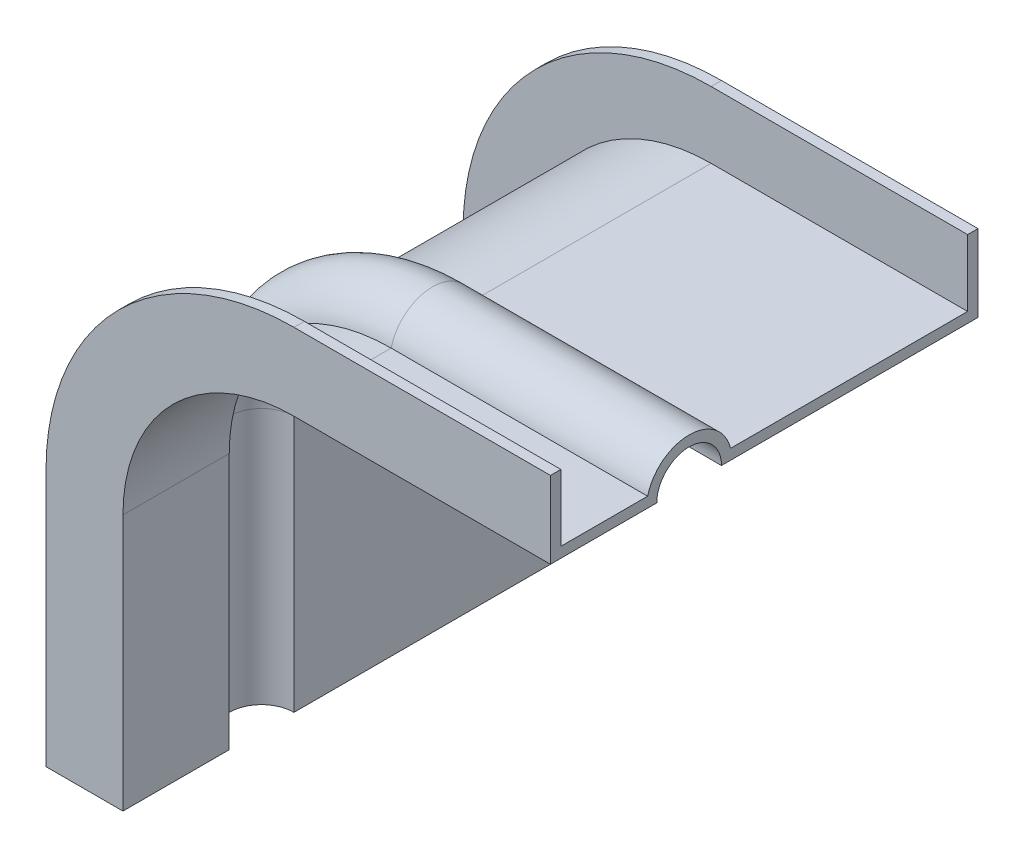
ISO-10303-21;
HEADER;
FILE_DESCRIPTION(('STEP AP214'),'2;1');
FILE_NAME('part.step','',(''),(''),'','','');
FILE_SCHEMA(('AUTOMOTIVE_DESIGN { 1 0 10303 214 1 1 1 1 }'));
ENDSEC;
DATA;
#1=APPLICATION_CONTEXT('core data for automotive mechanical design processes');
#2=APPLICATION_PROTOCOL_DEFINITION('international standard','automotive_design',2000,#1);
#3=PRODUCT_CONTEXT('',#1,'mechanical');
#4=PRODUCT('Part','Part','',(#3));
#5=PRODUCT_RELATED_PRODUCT_CATEGORY('part','',(#4));
#6=PRODUCT_DEFINITION_FORMATION('','',#4);
#7=PRODUCT_DEFINITION_CONTEXT('part definition',#1,'design');
#8=PRODUCT_DEFINITION('design','',#6,#7);
#9=PRODUCT_DEFINITION_SHAPE('','',#8);
#10=(LENGTH_UNIT() NAMED_UNIT(*) SI_UNIT(.MILLI.,.METRE.));
#11=(NAMED_UNIT(*) PLANE_ANGLE_UNIT() SI_UNIT($,.RADIAN.));
#12=(NAMED_UNIT(*) SI_UNIT($,.STERADIAN.) SOLID_ANGLE_UNIT());
#13=UNCERTAINTY_MEASURE_WITH_UNIT(LENGTH_MEASURE(1.E-05),#10,'distance_accuracy_value','');
#14=(GEOMETRIC_REPRESENTATION_CONTEXT(3) GLOBAL_UNCERTAINTY_ASSIGNED_CONTEXT((#13)) GLOBAL_UNIT_ASSIGNED_CONTEXT((#10,
#11,#12)) REPRESENTATION_CONTEXT('',''));
#15=CARTESIAN_POINT('',(0.,0.,0.));
#16=DIRECTION('',(0.,0.,1.));
#17=DIRECTION('',(1.,0.,0.));
#18=AXIS2_PLACEMENT_3D('',#15,#16,#17);
#19=CARTESIAN_POINT('',(20.,59.,50.));
#20=DIRECTION('',(0.,1.,0.));
#21=DIRECTION('',(0.,0.,1.));
#22=AXIS2_PLACEMENT_3D('',#19,#20,#21);
#23=PLANE('',#22);
#24=DIRECTION('',(0.,0.,1.));
#25=VECTOR('',#24,1.);
#26=CARTESIAN_POINT('',(20.,59.,50.));
#27=LINE('',#26,#25);
#28=CARTESIAN_POINT('',(20.,59.,48.786));
#29=VERTEX_POINT('',#28);
#30=CARTESIAN_POINT('',(20.,59.,50.));
#31=VERTEX_POINT('',#30);
#32=EDGE_CURVE('E199',#29,#31,#27,.T.);
#33=ORIENTED_EDGE('',*,*,#32,.T.);
#34=DIRECTION('',(1.,0.,0.));
#35=VECTOR('',#34,1.);
#36=CARTESIAN_POINT('',(20.,59.,50.));
#37=LINE('',#36,#35);
#38=CARTESIAN_POINT('',(50.,59.,50.));
#39=VERTEX_POINT('',#38);
#40=EDGE_CURVE('E37',#31,#39,#37,.T.);
#41=ORIENTED_EDGE('',*,*,#40,.T.);
#42=DIRECTION('',(0.,0.,1.));
#43=VECTOR('',#42,1.);
#44=CARTESIAN_POINT('',(50.,59.,50.));
#45=LINE('',#44,#43);
#46=CARTESIAN_POINT('',(50.,59.,48.786));
#47=VERTEX_POINT('',#46);
#48=EDGE_CURVE('E44',#47,#39,#45,.T.);
#49=ORIENTED_EDGE('',*,*,#48,.F.);
#50=DIRECTION('',(1.,0.,0.));
#51=VECTOR('',#50,1.);
#52=CARTESIAN_POINT('',(20.,59.,48.786));
#53=LINE('',#52,#51);
#54=EDGE_CURVE('E11',#29,#47,#53,.T.);
#55=ORIENTED_EDGE('',*,*,#54,.F.);
#56=EDGE_LOOP('',(#33,#41,#49,#55));
#57=FACE_BOUND('',#56,.T.);
#58=ADVANCED_FACE('F30',(#57),#23,.T.);
#59=CARTESIAN_POINT('',(20.,50.,50.));
#60=DIRECTION('',(0.,-1.,0.));
#61=DIRECTION('',(0.,0.,-1.));
#62=AXIS2_PLACEMENT_3D('',#59,#60,#61);
#63=PLANE('',#62);
#64=DIRECTION('',(0.,0.,-1.));
#65=VECTOR('',#64,1.);
#66=CARTESIAN_POINT('',(20.,50.,50.));
#67=LINE('',#66,#65);
#68=CARTESIAN_POINT('',(20.,50.,50.));
#69=VERTEX_POINT('',#68);
#70=CARTESIAN_POINT('',(20.,50.,37.572));
#71=VERTEX_POINT('',#70);
#72=EDGE_CURVE('E242',#69,#71,#67,.T.);
#73=ORIENTED_EDGE('',*,*,#72,.T.);
#74=DIRECTION('',(1.,0.,0.));
#75=VECTOR('',#74,1.);
#76=CARTESIAN_POINT('',(20.,50.,37.572));
#77=LINE('',#76,#75);
#78=CARTESIAN_POINT('',(50.,50.,37.572));
#79=VERTEX_POINT('',#78);
#80=EDGE_CURVE('E331',#71,#79,#77,.T.);
#81=ORIENTED_EDGE('',*,*,#80,.T.);
#82=DIRECTION('',(0.,0.,-1.));
#83=VECTOR('',#82,1.);
#84=CARTESIAN_POINT('',(50.,50.,50.));
#85=LINE('',#84,#83);
#86=CARTESIAN_POINT('',(50.,50.,50.));
#87=VERTEX_POINT('',#86);
#88=EDGE_CURVE('E302',#87,#79,#85,.T.);
#89=ORIENTED_EDGE('',*,*,#88,.F.);
#90=DIRECTION('',(1.,0.,0.));
#91=VECTOR('',#90,1.);
#92=CARTESIAN_POINT('',(20.,50.,50.));
#93=LINE('',#92,#91);
#94=EDGE_CURVE('E334',#69,#87,#93,.T.);
#95=ORIENTED_EDGE('',*,*,#94,.F.);
#96=EDGE_LOOP('',(#73,#81,#89,#95));
#97=FACE_BOUND('',#96,.T.);
#98=ADVANCED_FACE('F402',(#97),#63,.T.);
#99=CARTESIAN_POINT('',(20.,50.,33.786));
#100=DIRECTION('',(1.,0.,0.));
#101=DIRECTION('',(0.,0.,-1.));
#102=AXIS2_PLACEMENT_3D('',#99,#100,#101);
#103=CYLINDRICAL_SURFACE('',#102,3.786);
#104=CARTESIAN_POINT('',(20.,50.,33.786));
#105=DIRECTION('',(-1.,0.,0.));
#106=DIRECTION('',(0.,0.,-1.));
#107=AXIS2_PLACEMENT_3D('',#104,#105,#106);
#108=CIRCLE('',#107,3.786);
#109=CARTESIAN_POINT('',(20.,50.,30.));
#110=VERTEX_POINT('',#109);
#111=EDGE_CURVE('E239',#71,#110,#108,.T.);
#112=ORIENTED_EDGE('',*,*,#111,.T.);
#113=DIRECTION('',(1.,0.,0.));
#114=VECTOR('',#113,1.);
#115=CARTESIAN_POINT('',(20.,50.,30.));
#116=LINE('',#115,#114);
#117=CARTESIAN_POINT('',(50.,50.,30.));
#118=VERTEX_POINT('',#117);
#119=EDGE_CURVE('E328',#110,#118,#116,.T.);
#120=ORIENTED_EDGE('',*,*,#119,.T.);
#121=CARTESIAN_POINT('',(50.,50.,33.786));
#122=DIRECTION('',(-1.,0.,0.));
#123=DIRECTION('',(0.,0.,-1.));
#124=AXIS2_PLACEMENT_3D('',#121,#122,#123);
#125=CIRCLE('',#124,3.786);
#126=EDGE_CURVE('E299',#79,#118,#125,.T.);
#127=ORIENTED_EDGE('',*,*,#126,.F.);
#128=ORIENTED_EDGE('',*,*,#80,.F.);
#129=EDGE_LOOP('',(#112,#120,#127,#128));
#130=FACE_BOUND('',#129,.T.);
#131=ADVANCED_FACE('F408',(#130),#103,.F.);
#132=CARTESIAN_POINT('',(20.,50.,30.));
#133=DIRECTION('',(0.,-1.,0.));
#134=DIRECTION('',(0.,0.,-1.));
#135=AXIS2_PLACEMENT_3D('',#132,#133,#134);
#136=PLANE('',#135);
#137=DIRECTION('',(0.,0.,-1.));
#138=VECTOR('',#137,1.);
#139=CARTESIAN_POINT('',(20.,50.,30.));
#140=LINE('',#139,#138);
#141=CARTESIAN_POINT('',(20.,50.,0.));
#142=VERTEX_POINT('',#141);
#143=EDGE_CURVE('E236',#110,#142,#140,.T.);
#144=ORIENTED_EDGE('',*,*,#143,.T.);
#145=DIRECTION('',(1.,0.,0.));
#146=VECTOR('',#145,1.);
#147=CARTESIAN_POINT('',(20.,50.,0.));
#148=LINE('',#147,#146);
#149=CARTESIAN_POINT('',(50.,50.,0.));
#150=VERTEX_POINT('',#149);
#151=EDGE_CURVE('E325',#142,#150,#148,.T.);
#152=ORIENTED_EDGE('',*,*,#151,.T.);
#153=DIRECTION('',(0.,0.,-1.));
#154=VECTOR('',#153,1.);
#155=CARTESIAN_POINT('',(50.,50.,30.));
#156=LINE('',#155,#154);
#157=EDGE_CURVE('E296',#118,#150,#156,.T.);
#158=ORIENTED_EDGE('',*,*,#157,.F.);
#159=ORIENTED_EDGE('',*,*,#119,.F.);
#160=EDGE_LOOP('',(#144,#152,#158,#159));
#161=FACE_BOUND('',#160,.T.);
#162=ADVANCED_FACE('F413',(#161),#136,.T.);
#163=CARTESIAN_POINT('',(20.,59.,1.214));
#164=DIRECTION('',(0.,1.,0.));
#165=DIRECTION('',(0.,0.,1.));
#166=AXIS2_PLACEMENT_3D('',#163,#164,#165);
#167=PLANE('',#166);
#168=DIRECTION('',(0.,0.,1.));
#169=VECTOR('',#168,1.);
#170=CARTESIAN_POINT('',(20.,59.,1.214));
#171=LINE('',#170,#169);
#172=CARTESIAN_POINT('',(20.,59.,0.));
#173=VERTEX_POINT('',#172);
#174=CARTESIAN_POINT('',(20.,59.,1.214));
#175=VERTEX_POINT('',#174);
#176=EDGE_CURVE('E233',#173,#175,#171,.T.);
#177=ORIENTED_EDGE('',*,*,#176,.T.);
#178=DIRECTION('',(1.,0.,0.));
#179=VECTOR('',#178,1.);
#180=CARTESIAN_POINT('',(20.,59.,1.214));
#181=LINE('',#180,#179);
#182=CARTESIAN_POINT('',(50.,59.,1.214));
#183=VERTEX_POINT('',#182);
#184=EDGE_CURVE('E319',#175,#183,#181,.T.);
#185=ORIENTED_EDGE('',*,*,#184,.T.);
#186=DIRECTION('',(0.,0.,1.));
#187=VECTOR('',#186,1.);
#188=CARTESIAN_POINT('',(50.,59.,1.214));
#189=LINE('',#188,#187);
#190=CARTESIAN_POINT('',(50.,59.,0.));
#191=VERTEX_POINT('',#190);
#192=EDGE_CURVE('E290',#191,#183,#189,.T.);
#193=ORIENTED_EDGE('',*,*,#192,.F.);
#194=DIRECTION('',(1.,0.,0.));
#195=VECTOR('',#194,1.);
#196=CARTESIAN_POINT('',(20.,59.,0.));
#197=LINE('',#196,#195);
#198=EDGE_CURVE('E322',#173,#191,#197,.T.);
#199=ORIENTED_EDGE('',*,*,#198,.F.);
#200=EDGE_LOOP('',(#177,#185,#193,#199));
#201=FACE_BOUND('',#200,.T.);
#202=ADVANCED_FACE('F470',(#201),#167,.T.);
#203=CARTESIAN_POINT('',(20.,51.214,28.9356181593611));
#204=DIRECTION('',(0.,1.,0.));
#205=DIRECTION('',(0.,0.,1.));
#206=AXIS2_PLACEMENT_3D('',#203,#204,#205);
#207=PLANE('',#206);
#208=DIRECTION('',(0.,0.,1.));
#209=VECTOR('',#208,1.);
#210=CARTESIAN_POINT('',(20.,51.214,28.9356181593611));
#211=LINE('',#210,#209);
#212=CARTESIAN_POINT('',(20.,51.214,1.214));
#213=VERTEX_POINT('',#212);
#214=CARTESIAN_POINT('',(20.,51.214,28.9356181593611));
#215=VERTEX_POINT('',#214);
#216=EDGE_CURVE('E230',#213,#215,#211,.T.);
#217=ORIENTED_EDGE('',*,*,#216,.T.);
#218=DIRECTION('',(1.,0.,0.));
#219=VECTOR('',#218,1.);
#220=CARTESIAN_POINT('',(20.,51.214,28.9356181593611));
#221=LINE('',#220,#219);
#222=CARTESIAN_POINT('',(50.,51.214,28.9356181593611));
#223=VERTEX_POINT('',#222);
#224=EDGE_CURVE('E313',#215,#223,#221,.T.);
#225=ORIENTED_EDGE('',*,*,#224,.T.);
#226=DIRECTION('',(0.,0.,1.));
#227=VECTOR('',#226,1.);
#228=CARTESIAN_POINT('',(50.,51.214,28.9356181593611));
#229=LINE('',#228,#227);
#230=CARTESIAN_POINT('',(50.,51.214,1.214));
#231=VERTEX_POINT('',#230);
#232=EDGE_CURVE('E284',#231,#223,#229,.T.);
#233=ORIENTED_EDGE('',*,*,#232,.F.);
#234=DIRECTION('',(1.,0.,0.));
#235=VECTOR('',#234,1.);
#236=CARTESIAN_POINT('',(20.,51.214,1.214));
#237=LINE('',#236,#235);
#238=EDGE_CURVE('E316',#213,#231,#237,.T.);
#239=ORIENTED_EDGE('',*,*,#238,.F.);
#240=EDGE_LOOP('',(#217,#225,#233,#239));
#241=FACE_BOUND('',#240,.T.);
#242=ADVANCED_FACE('F473',(#241),#207,.T.);
#243=CARTESIAN_POINT('',(20.,50.,33.786));
#244=DIRECTION('',(1.,0.,0.));
#245=DIRECTION('',(0.,0.,-1.));
#246=AXIS2_PLACEMENT_3D('',#243,#244,#245);
#247=CYLINDRICAL_SURFACE('',#246,5.);
#248=CARTESIAN_POINT('',(20.,50.,33.786));
#249=DIRECTION('',(1.,0.,0.));
#250=DIRECTION('',(0.,0.,1.));
#251=AXIS2_PLACEMENT_3D('',#248,#249,#250);
#252=CIRCLE('',#251,5.);
#253=CARTESIAN_POINT('',(20.,51.214,38.6363818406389));
#254=VERTEX_POINT('',#253);
#255=EDGE_CURVE('E222',#215,#254,#252,.T.);
#256=ORIENTED_EDGE('',*,*,#255,.T.);
#257=DIRECTION('',(1.,0.,0.));
#258=VECTOR('',#257,1.);
#259=CARTESIAN_POINT('',(20.,51.214,38.6363818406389));
#260=LINE('',#259,#258);
#261=CARTESIAN_POINT('',(50.,51.214,38.6363818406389));
#262=VERTEX_POINT('',#261);
#263=EDGE_CURVE('E310',#254,#262,#260,.T.);
#264=ORIENTED_EDGE('',*,*,#263,.T.);
#265=CARTESIAN_POINT('',(50.,50.,33.786));
#266=DIRECTION('',(1.,0.,0.));
#267=DIRECTION('',(0.,0.,1.));
#268=AXIS2_PLACEMENT_3D('',#265,#266,#267);
#269=CIRCLE('',#268,5.);
#270=EDGE_CURVE('E281',#223,#262,#269,.T.);
#271=ORIENTED_EDGE('',*,*,#270,.F.);
#272=ORIENTED_EDGE('',*,*,#224,.F.);
#273=EDGE_LOOP('',(#256,#264,#271,#272));
#274=FACE_BOUND('',#273,.T.);
#275=ADVANCED_FACE('F484',(#274),#247,.T.);
#276=CARTESIAN_POINT('',(20.,51.214,48.786));
#277=DIRECTION('',(0.,1.,0.));
#278=DIRECTION('',(0.,0.,1.));
#279=AXIS2_PLACEMENT_3D('',#276,#277,#278);
#280=PLANE('',#279);
#281=DIRECTION('',(0.,0.,1.));
#282=VECTOR('',#281,1.);
#283=CARTESIAN_POINT('',(20.,51.214,48.786));
#284=LINE('',#283,#282);
#285=CARTESIAN_POINT('',(20.,51.214,48.786));
#286=VERTEX_POINT('',#285);
#287=EDGE_CURVE('E219',#254,#286,#284,.T.);
#288=ORIENTED_EDGE('',*,*,#287,.T.);
#289=DIRECTION('',(1.,0.,0.));
#290=VECTOR('',#289,1.);
#291=CARTESIAN_POINT('',(20.,51.214,48.786));
#292=LINE('',#291,#290);
#293=CARTESIAN_POINT('',(50.,51.214,48.786));
#294=VERTEX_POINT('',#293);
#295=EDGE_CURVE('E307',#286,#294,#292,.T.);
#296=ORIENTED_EDGE('',*,*,#295,.T.);
#297=DIRECTION('',(0.,0.,1.));
#298=VECTOR('',#297,1.);
#299=CARTESIAN_POINT('',(50.,51.214,48.786));
#300=LINE('',#299,#298);
#301=EDGE_CURVE('E278',#262,#294,#300,.T.);
#302=ORIENTED_EDGE('',*,*,#301,.F.);
#303=ORIENTED_EDGE('',*,*,#263,.F.);
#304=EDGE_LOOP('',(#288,#296,#302,#303));
#305=FACE_BOUND('',#304,.T.);
#306=ADVANCED_FACE('F419',(#305),#280,.T.);
#307=CARTESIAN_POINT('',(20.,30.,0.));
#308=DIRECTION('',(0.,0.,-1.));
#309=DIRECTION('',(-1.,0.,0.));
#310=AXIS2_PLACEMENT_3D('',#307,#308,#309);
#311=CYLINDRICAL_SURFACE('',#310,29.);
#312=DIRECTION('',(0.,0.,1.));
#313=VECTOR('',#312,1.);
#314=CARTESIAN_POINT('',(-9.,30.,50.));
#315=LINE('',#314,#313);
#316=CARTESIAN_POINT('',(-9.,30.,48.786));
#317=VERTEX_POINT('',#316);
#318=CARTESIAN_POINT('',(-9.,30.,50.));
#319=VERTEX_POINT('',#318);
#320=EDGE_CURVE('E196',#317,#319,#315,.T.);
#321=ORIENTED_EDGE('',*,*,#320,.T.);
#322=CARTESIAN_POINT('',(20.,30.,50.));
#323=DIRECTION('',(0.,0.,-1.));
#324=DIRECTION('',(-1.,0.,0.));
#325=AXIS2_PLACEMENT_3D('',#322,#323,#324);
#326=CIRCLE('',#325,29.);
#327=EDGE_CURVE('E203',#319,#31,#326,.T.);
#328=ORIENTED_EDGE('',*,*,#327,.T.);
#329=ORIENTED_EDGE('',*,*,#32,.F.);
#330=CARTESIAN_POINT('',(20.,30.,48.786));
#331=DIRECTION('',(0.,0.,-1.));
#332=DIRECTION('',(-1.,0.,0.));
#333=AXIS2_PLACEMENT_3D('',#330,#331,#332);
#334=CIRCLE('',#333,29.);
#335=EDGE_CURVE('E192',#317,#29,#334,.T.);
#336=ORIENTED_EDGE('',*,*,#335,.F.);
#337=EDGE_LOOP('',(#321,#328,#329,#336));
#338=FACE_BOUND('',#337,.T.);
#339=ADVANCED_FACE('F194',(#338),#311,.T.);
#340=CARTESIAN_POINT('',(20.,30.,0.));
#341=DIRECTION('',(0.,0.,-1.));
#342=DIRECTION('',(-1.,0.,0.));
#343=AXIS2_PLACEMENT_3D('',#340,#341,#342);
#344=CYLINDRICAL_SURFACE('',#343,20.);
#345=DIRECTION('',(0.,0.,-1.));
#346=VECTOR('',#345,1.);
#347=CARTESIAN_POINT('',(0.,30.,50.));
#348=LINE('',#347,#346);
#349=CARTESIAN_POINT('',(0.,30.,50.));
#350=VERTEX_POINT('',#349);
#351=CARTESIAN_POINT('',(0.,30.,37.572));
#352=VERTEX_POINT('',#351);
#353=EDGE_CURVE('E212',#350,#352,#348,.T.);
#354=ORIENTED_EDGE('',*,*,#353,.T.);
#355=CARTESIAN_POINT('',(20.,30.,37.572));
#356=DIRECTION('',(0.,0.,-1.));
#357=DIRECTION('',(-1.,0.,0.));
#358=AXIS2_PLACEMENT_3D('',#355,#356,#357);
#359=CIRCLE('',#358,20.);
#360=EDGE_CURVE('E270',#352,#71,#359,.T.);
#361=ORIENTED_EDGE('',*,*,#360,.T.);
#362=ORIENTED_EDGE('',*,*,#72,.F.);
#363=CARTESIAN_POINT('',(20.,30.,50.));
#364=DIRECTION('',(0.,0.,-1.));
#365=DIRECTION('',(-1.,0.,0.));
#366=AXIS2_PLACEMENT_3D('',#363,#364,#365);
#367=CIRCLE('',#366,20.);
#368=EDGE_CURVE('E273',#350,#69,#367,.T.);
#369=ORIENTED_EDGE('',*,*,#368,.F.);
#370=EDGE_LOOP('',(#354,#361,#362,#369));
#371=FACE_BOUND('',#370,.T.);
#372=ADVANCED_FACE('F399',(#371),#344,.F.);
#373=CARTESIAN_POINT('',(20.,30.,33.786));
#374=DIRECTION('',(0.,0.,-1.));
#375=DIRECTION('',(-1.,0.,0.));
#376=AXIS2_PLACEMENT_3D('',#373,#374,#375);
#377=TOROIDAL_SURFACE('',#376,20.,3.786);
#378=CARTESIAN_POINT('',(0.,30.,33.786));
#379=DIRECTION('',(0.,-1.,0.));
#380=DIRECTION('',(0.,0.,-1.));
#381=AXIS2_PLACEMENT_3D('',#378,#379,#380);
#382=CIRCLE('',#381,3.786);
#383=CARTESIAN_POINT('',(0.,30.,30.));
#384=VERTEX_POINT('',#383);
#385=EDGE_CURVE('E441',#352,#384,#382,.T.);
#386=ORIENTED_EDGE('',*,*,#385,.T.);
#387=CARTESIAN_POINT('',(20.,30.,30.));
#388=DIRECTION('',(0.,0.,-1.));
#389=DIRECTION('',(-1.,0.,0.));
#390=AXIS2_PLACEMENT_3D('',#387,#388,#389);
#391=CIRCLE('',#390,20.);
#392=EDGE_CURVE('E267',#384,#110,#391,.T.);
#393=ORIENTED_EDGE('',*,*,#392,.T.);
#394=ORIENTED_EDGE('',*,*,#111,.F.);
#395=ORIENTED_EDGE('',*,*,#360,.F.);
#396=EDGE_LOOP('',(#386,#393,#394,#395));
#397=FACE_BOUND('',#396,.T.);
#398=ADVANCED_FACE('F405',(#397),#377,.F.);
#399=CARTESIAN_POINT('',(20.,30.,0.));
#400=DIRECTION('',(0.,0.,-1.));
#401=DIRECTION('',(-1.,0.,0.));
#402=AXIS2_PLACEMENT_3D('',#399,#400,#401);
#403=CYLINDRICAL_SURFACE('',#402,20.);
#404=DIRECTION('',(0.,0.,-1.));
#405=VECTOR('',#404,1.);
#406=CARTESIAN_POINT('',(0.,30.,30.));
#407=LINE('',#406,#405);
#408=CARTESIAN_POINT('',(0.,30.,0.));
#409=VERTEX_POINT('',#408);
#410=EDGE_CURVE('E439',#384,#409,#407,.T.);
#411=ORIENTED_EDGE('',*,*,#410,.T.);
#412=CARTESIAN_POINT('',(20.,30.,0.));
#413=DIRECTION('',(0.,0.,-1.));
#414=DIRECTION('',(-1.,0.,0.));
#415=AXIS2_PLACEMENT_3D('',#412,#413,#414);
#416=CIRCLE('',#415,20.);
#417=EDGE_CURVE('E264',#409,#142,#416,.T.);
#418=ORIENTED_EDGE('',*,*,#417,.T.);
#419=ORIENTED_EDGE('',*,*,#143,.F.);
#420=ORIENTED_EDGE('',*,*,#392,.F.);
#421=EDGE_LOOP('',(#411,#418,#419,#420));
#422=FACE_BOUND('',#421,.T.);
#423=ADVANCED_FACE('F411',(#422),#403,.F.);
#424=CARTESIAN_POINT('',(20.,30.,0.));
#425=DIRECTION('',(0.,0.,-1.));
#426=DIRECTION('',(-1.,0.,0.));
#427=AXIS2_PLACEMENT_3D('',#424,#425,#426);
#428=CYLINDRICAL_SURFACE('',#427,29.);
#429=DIRECTION('',(0.,0.,1.));
#430=VECTOR('',#429,1.);
#431=CARTESIAN_POINT('',(-9.,30.,1.214));
#432=LINE('',#431,#430);
#433=CARTESIAN_POINT('',(-9.,30.,0.));
#434=VERTEX_POINT('',#433);
#435=CARTESIAN_POINT('',(-9.,30.,1.214));
#436=VERTEX_POINT('',#435);
#437=EDGE_CURVE('E436',#434,#436,#432,.T.);
#438=ORIENTED_EDGE('',*,*,#437,.T.);
#439=CARTESIAN_POINT('',(20.,30.,1.214));
#440=DIRECTION('',(0.,0.,-1.));
#441=DIRECTION('',(-1.,0.,0.));
#442=AXIS2_PLACEMENT_3D('',#439,#440,#441);
#443=CIRCLE('',#442,29.);
#444=EDGE_CURVE('E258',#436,#175,#443,.T.);
#445=ORIENTED_EDGE('',*,*,#444,.T.);
#446=ORIENTED_EDGE('',*,*,#176,.F.);
#447=CARTESIAN_POINT('',(20.,30.,0.));
#448=DIRECTION('',(0.,0.,-1.));
#449=DIRECTION('',(-1.,0.,0.));
#450=AXIS2_PLACEMENT_3D('',#447,#448,#449);
#451=CIRCLE('',#450,29.);
#452=EDGE_CURVE('E261',#434,#173,#451,.T.);
#453=ORIENTED_EDGE('',*,*,#452,.F.);
#454=EDGE_LOOP('',(#438,#445,#446,#453));
#455=FACE_BOUND('',#454,.T.);
#456=ADVANCED_FACE('F468',(#455),#428,.T.);
#457=CARTESIAN_POINT('',(20.,30.,0.));
#458=DIRECTION('',(0.,0.,-1.));
#459=DIRECTION('',(-1.,0.,0.));
#460=AXIS2_PLACEMENT_3D('',#457,#458,#459);
#461=CYLINDRICAL_SURFACE('',#460,21.214);
#462=DIRECTION('',(0.,0.,1.));
#463=VECTOR('',#462,1.);
#464=CARTESIAN_POINT('',(-1.214,30.,28.9356181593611));
#465=LINE('',#464,#463);
#466=CARTESIAN_POINT('',(-1.214,30.,1.214));
#467=VERTEX_POINT('',#466);
#468=CARTESIAN_POINT('',(-1.214,30.,28.9356181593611));
#469=VERTEX_POINT('',#468);
#470=EDGE_CURVE('E433',#467,#469,#465,.T.);
#471=ORIENTED_EDGE('',*,*,#470,.T.);
#472=CARTESIAN_POINT('',(20.,30.,28.9356181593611));
#473=DIRECTION('',(0.,0.,-1.));
#474=DIRECTION('',(-1.,0.,0.));
#475=AXIS2_PLACEMENT_3D('',#472,#473,#474);
#476=CIRCLE('',#475,21.214);
#477=EDGE_CURVE('E252',#469,#215,#476,.T.);
#478=ORIENTED_EDGE('',*,*,#477,.T.);
#479=ORIENTED_EDGE('',*,*,#216,.F.);
#480=CARTESIAN_POINT('',(20.,30.,1.214));
#481=DIRECTION('',(0.,0.,-1.));
#482=DIRECTION('',(-1.,0.,0.));
#483=AXIS2_PLACEMENT_3D('',#480,#481,#482);
#484=CIRCLE('',#483,21.214);
#485=EDGE_CURVE('E255',#467,#213,#484,.T.);
#486=ORIENTED_EDGE('',*,*,#485,.F.);
#487=EDGE_LOOP('',(#471,#478,#479,#486));
#488=FACE_BOUND('',#487,.T.);
#489=ADVANCED_FACE('F476',(#488),#461,.T.);
#490=CARTESIAN_POINT('',(20.,30.,33.786));
#491=DIRECTION('',(0.,0.,-1.));
#492=DIRECTION('',(-1.,0.,0.));
#493=AXIS2_PLACEMENT_3D('',#490,#491,#492);
#494=TOROIDAL_SURFACE('',#493,20.,5.);
#495=CARTESIAN_POINT('',(0.,30.,33.786));
#496=DIRECTION('',(0.,1.,0.));
#497=DIRECTION('',(0.,0.,1.));
#498=AXIS2_PLACEMENT_3D('',#495,#496,#497);
#499=CIRCLE('',#498,5.);
#500=CARTESIAN_POINT('',(-1.214,30.,38.6363818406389));
#501=VERTEX_POINT('',#500);
#502=EDGE_CURVE('E426',#469,#501,#499,.T.);
#503=ORIENTED_EDGE('',*,*,#502,.T.);
#504=CARTESIAN_POINT('',(20.,30.,38.6363818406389));
#505=DIRECTION('',(0.,0.,-1.));
#506=DIRECTION('',(-1.,0.,0.));
#507=AXIS2_PLACEMENT_3D('',#504,#505,#506);
#508=CIRCLE('',#507,21.214);
#509=EDGE_CURVE('E249',#501,#254,#508,.T.);
#510=ORIENTED_EDGE('',*,*,#509,.T.);
#511=ORIENTED_EDGE('',*,*,#255,.F.);
#512=ORIENTED_EDGE('',*,*,#477,.F.);
#513=EDGE_LOOP('',(#503,#510,#511,#512));
#514=FACE_BOUND('',#513,.T.);
#515=ADVANCED_FACE('F480',(#514),#494,.T.);
#516=CARTESIAN_POINT('',(20.,30.,0.));
#517=DIRECTION('',(0.,0.,-1.));
#518=DIRECTION('',(-1.,0.,0.));
#519=AXIS2_PLACEMENT_3D('',#516,#517,#518);
#520=CYLINDRICAL_SURFACE('',#519,21.214);
#521=DIRECTION('',(0.,0.,1.));
#522=VECTOR('',#521,1.);
#523=CARTESIAN_POINT('',(-1.214,30.,48.786));
#524=LINE('',#523,#522);
#525=CARTESIAN_POINT('',(-1.214,30.,48.786));
#526=VERTEX_POINT('',#525);
#527=EDGE_CURVE('E369',#501,#526,#524,.T.);
#528=ORIENTED_EDGE('',*,*,#527,.T.);
#529=CARTESIAN_POINT('',(20.,30.,48.786));
#530=DIRECTION('',(0.,0.,-1.));
#531=DIRECTION('',(-1.,0.,0.));
#532=AXIS2_PLACEMENT_3D('',#529,#530,#531);
#533=CIRCLE('',#532,21.214);
#534=EDGE_CURVE('E246',#526,#286,#533,.T.);
#535=ORIENTED_EDGE('',*,*,#534,.T.);
#536=ORIENTED_EDGE('',*,*,#287,.F.);
#537=ORIENTED_EDGE('',*,*,#509,.F.);
#538=EDGE_LOOP('',(#528,#535,#536,#537));
#539=FACE_BOUND('',#538,.T.);
#540=ADVANCED_FACE('F421',(#539),#520,.T.);
#541=CARTESIAN_POINT('',(-9.,30.,48.786));
#542=DIRECTION('',(0.,0.,1.));
#543=DIRECTION('',(1.,0.,0.));
#544=AXIS2_PLACEMENT_3D('',#541,#542,#543);
#545=PLANE('',#544);
#546=DIRECTION('',(-1.,0.,0.));
#547=VECTOR('',#546,1.);
#548=CARTESIAN_POINT('',(-9.,0.,48.786));
#549=LINE('',#548,#547);
#550=CARTESIAN_POINT('',(-1.214,0.,48.786));
#551=VERTEX_POINT('',#550);
#552=CARTESIAN_POINT('',(-9.,0.,48.786));
#553=VERTEX_POINT('',#552);
#554=EDGE_CURVE('E218',#551,#553,#549,.T.);
#555=ORIENTED_EDGE('',*,*,#554,.T.);
#556=DIRECTION('',(0.,-1.,0.));
#557=VECTOR('',#556,1.);
#558=CARTESIAN_POINT('',(-9.,30.,48.786));
#559=LINE('',#558,#557);
#560=EDGE_CURVE('E208',#317,#553,#559,.T.);
#561=ORIENTED_EDGE('',*,*,#560,.F.);
#562=ORIENTED_EDGE('',*,*,#335,.T.);
#563=ORIENTED_EDGE('',*,*,#54,.T.);
#564=DIRECTION('',(0.,1.,0.));
#565=VECTOR('',#564,1.);
#566=CARTESIAN_POINT('',(50.,59.,48.786));
#567=LINE('',#566,#565);
#568=EDGE_CURVE('E202',#294,#47,#567,.T.);
#569=ORIENTED_EDGE('',*,*,#568,.F.);
#570=ORIENTED_EDGE('',*,*,#295,.F.);
#571=ORIENTED_EDGE('',*,*,#534,.F.);
#572=DIRECTION('',(0.,-1.,0.));
#573=VECTOR('',#572,1.);
#574=CARTESIAN_POINT('',(-1.214,30.,48.786));
#575=LINE('',#574,#573);
#576=EDGE_CURVE('E366',#526,#551,#575,.T.);
#577=ORIENTED_EDGE('',*,*,#576,.T.);
#578=EDGE_LOOP('',(#555,#561,#562,#563,#569,#570,#571,#577));
#579=FACE_BOUND('',#578,.T.);
#580=ADVANCED_FACE('F215',(#579),#545,.F.);
#581=CARTESIAN_POINT('',(-9.,30.,50.));
#582=DIRECTION('',(1.,0.,0.));
#583=DIRECTION('',(0.,0.,-1.));
#584=AXIS2_PLACEMENT_3D('',#581,#582,#583);
#585=PLANE('',#584);
#586=DIRECTION('',(0.,0.,1.));
#587=VECTOR('',#586,1.);
#588=CARTESIAN_POINT('',(-9.,0.,50.));
#589=LINE('',#588,#587);
#590=CARTESIAN_POINT('',(-9.,0.,50.));
#591=VERTEX_POINT('',#590);
#592=EDGE_CURVE('E343',#553,#591,#589,.T.);
#593=ORIENTED_EDGE('',*,*,#592,.T.);
#594=DIRECTION('',(0.,-1.,0.));
#595=VECTOR('',#594,1.);
#596=CARTESIAN_POINT('',(-9.,30.,50.));
#597=LINE('',#596,#595);
#598=EDGE_CURVE('E211',#319,#591,#597,.T.);
#599=ORIENTED_EDGE('',*,*,#598,.F.);
#600=ORIENTED_EDGE('',*,*,#320,.F.);
#601=ORIENTED_EDGE('',*,*,#560,.T.);
#602=EDGE_LOOP('',(#593,#599,#600,#601));
#603=FACE_BOUND('',#602,.T.);
#604=ADVANCED_FACE('F207',(#603),#585,.F.);
#605=CARTESIAN_POINT('',(-9.,30.,50.));
#606=DIRECTION('',(0.,0.,-1.));
#607=DIRECTION('',(-1.,0.,0.));
#608=AXIS2_PLACEMENT_3D('',#605,#606,#607);
#609=PLANE('',#608);
#610=DIRECTION('',(1.,0.,0.));
#611=VECTOR('',#610,1.);
#612=CARTESIAN_POINT('',(-9.,0.,50.));
#613=LINE('',#612,#611);
#614=CARTESIAN_POINT('',(0.,0.,50.));
#615=VERTEX_POINT('',#614);
#616=EDGE_CURVE('E338',#591,#615,#613,.T.);
#617=ORIENTED_EDGE('',*,*,#616,.T.);
#618=DIRECTION('',(0.,-1.,0.));
#619=VECTOR('',#618,1.);
#620=CARTESIAN_POINT('',(0.,30.,50.));
#621=LINE('',#620,#619);
#622=EDGE_CURVE('E224',#350,#615,#621,.T.);
#623=ORIENTED_EDGE('',*,*,#622,.F.);
#624=ORIENTED_EDGE('',*,*,#368,.T.);
#625=ORIENTED_EDGE('',*,*,#94,.T.);
#626=DIRECTION('',(0.,-1.,0.));
#627=VECTOR('',#626,1.);
#628=CARTESIAN_POINT('',(50.,59.,50.));
#629=LINE('',#628,#627);
#630=EDGE_CURVE('E52',#39,#87,#629,.T.);
#631=ORIENTED_EDGE('',*,*,#630,.F.);
#632=ORIENTED_EDGE('',*,*,#40,.F.);
#633=ORIENTED_EDGE('',*,*,#327,.F.);
#634=ORIENTED_EDGE('',*,*,#598,.T.);
#635=EDGE_LOOP('',(#617,#623,#624,#625,#631,#632,#633,#634));
#636=FACE_BOUND('',#635,.T.);
#637=ADVANCED_FACE('F335',(#636),#609,.F.);
#638=CARTESIAN_POINT('',(0.,30.,50.));
#639=DIRECTION('',(-1.,0.,0.));
#640=DIRECTION('',(0.,0.,1.));
#641=AXIS2_PLACEMENT_3D('',#638,#639,#640);
#642=PLANE('',#641);
#643=DIRECTION('',(0.,0.,-1.));
#644=VECTOR('',#643,1.);
#645=CARTESIAN_POINT('',(0.,0.,50.));
#646=LINE('',#645,#644);
#647=CARTESIAN_POINT('',(0.,0.,37.572));
#648=VERTEX_POINT('',#647);
#649=EDGE_CURVE('E345',#615,#648,#646,.T.);
#650=ORIENTED_EDGE('',*,*,#649,.T.);
#651=DIRECTION('',(0.,-1.,0.));
#652=VECTOR('',#651,1.);
#653=CARTESIAN_POINT('',(0.,30.,37.572));
#654=LINE('',#653,#652);
#655=EDGE_CURVE('E390',#352,#648,#654,.T.);
#656=ORIENTED_EDGE('',*,*,#655,.F.);
#657=ORIENTED_EDGE('',*,*,#353,.F.);
#658=ORIENTED_EDGE('',*,*,#622,.T.);
#659=EDGE_LOOP('',(#650,#656,#657,#658));
#660=FACE_BOUND('',#659,.T.);
#661=ADVANCED_FACE('F394',(#660),#642,.F.);
#662=CARTESIAN_POINT('',(0.,30.,33.786));
#663=DIRECTION('',(0.,-1.,0.));
#664=DIRECTION('',(0.,0.,-1.));
#665=AXIS2_PLACEMENT_3D('',#662,#663,#664);
#666=CYLINDRICAL_SURFACE('',#665,3.786);
#667=CARTESIAN_POINT('',(0.,0.,33.786));
#668=DIRECTION('',(0.,-1.,0.));
#669=DIRECTION('',(0.,0.,-1.));
#670=AXIS2_PLACEMENT_3D('',#667,#668,#669);
#671=CIRCLE('',#670,3.786);
#672=CARTESIAN_POINT('',(0.,0.,30.));
#673=VERTEX_POINT('',#672);
#674=EDGE_CURVE('E347',#648,#673,#671,.T.);
#675=ORIENTED_EDGE('',*,*,#674,.T.);
#676=DIRECTION('',(0.,-1.,0.));
#677=VECTOR('',#676,1.);
#678=CARTESIAN_POINT('',(0.,30.,30.));
#679=LINE('',#678,#677);
#680=EDGE_CURVE('E387',#384,#673,#679,.T.);
#681=ORIENTED_EDGE('',*,*,#680,.F.);
#682=ORIENTED_EDGE('',*,*,#385,.F.);
#683=ORIENTED_EDGE('',*,*,#655,.T.);
#684=EDGE_LOOP('',(#675,#681,#682,#683));
#685=FACE_BOUND('',#684,.T.);
#686=ADVANCED_FACE('F447',(#685),#666,.F.);
#687=CARTESIAN_POINT('',(0.,30.,30.));
#688=DIRECTION('',(-1.,0.,0.));
#689=DIRECTION('',(0.,0.,1.));
#690=AXIS2_PLACEMENT_3D('',#687,#688,#689);
#691=PLANE('',#690);
#692=DIRECTION('',(0.,0.,-1.));
#693=VECTOR('',#692,1.);
#694=CARTESIAN_POINT('',(0.,0.,30.));
#695=LINE('',#694,#693);
#696=CARTESIAN_POINT('',(0.,0.,0.));
#697=VERTEX_POINT('',#696);
#698=EDGE_CURVE('E353',#673,#697,#695,.T.);
#699=ORIENTED_EDGE('',*,*,#698,.T.);
#700=DIRECTION('',(0.,-1.,0.));
#701=VECTOR('',#700,1.);
#702=CARTESIAN_POINT('',(0.,30.,0.));
#703=LINE('',#702,#701);
#704=EDGE_CURVE('E384',#409,#697,#703,.T.);
#705=ORIENTED_EDGE('',*,*,#704,.F.);
#706=ORIENTED_EDGE('',*,*,#410,.F.);
#707=ORIENTED_EDGE('',*,*,#680,.T.);
#708=EDGE_LOOP('',(#699,#705,#706,#707));
#709=FACE_BOUND('',#708,.T.);
#710=ADVANCED_FACE('F451',(#709),#691,.F.);
#711=CARTESIAN_POINT('',(0.,30.,0.));
#712=DIRECTION('',(0.,0.,1.));
#713=DIRECTION('',(1.,0.,0.));
#714=AXIS2_PLACEMENT_3D('',#711,#712,#713);
#715=PLANE('',#714);
#716=DIRECTION('',(-1.,0.,0.));
#717=VECTOR('',#716,1.);
#718=CARTESIAN_POINT('',(0.,0.,0.));
#719=LINE('',#718,#717);
#720=CARTESIAN_POINT('',(-9.,0.,0.));
#721=VERTEX_POINT('',#720);
#722=EDGE_CURVE('E355',#697,#721,#719,.T.);
#723=ORIENTED_EDGE('',*,*,#722,.T.);
#724=DIRECTION('',(0.,-1.,0.));
#725=VECTOR('',#724,1.);
#726=CARTESIAN_POINT('',(-9.,30.,0.));
#727=LINE('',#726,#725);
#728=EDGE_CURVE('E381',#434,#721,#727,.T.);
#729=ORIENTED_EDGE('',*,*,#728,.F.);
#730=ORIENTED_EDGE('',*,*,#452,.T.);
#731=ORIENTED_EDGE('',*,*,#198,.T.);
#732=DIRECTION('',(0.,1.,0.));
#733=VECTOR('',#732,1.);
#734=CARTESIAN_POINT('',(50.,50.,0.));
#735=LINE('',#734,#733);
#736=EDGE_CURVE('E293',#150,#191,#735,.T.);
#737=ORIENTED_EDGE('',*,*,#736,.F.);
#738=ORIENTED_EDGE('',*,*,#151,.F.);
#739=ORIENTED_EDGE('',*,*,#417,.F.);
#740=ORIENTED_EDGE('',*,*,#704,.T.);
#741=EDGE_LOOP('',(#723,#729,#730,#731,#737,#738,#739,#740));
#742=FACE_BOUND('',#741,.T.);
#743=ADVANCED_FACE('F454',(#742),#715,.F.);
#744=CARTESIAN_POINT('',(-9.,30.,1.214));
#745=DIRECTION('',(1.,0.,0.));
#746=DIRECTION('',(0.,0.,-1.));
#747=AXIS2_PLACEMENT_3D('',#744,#745,#746);
#748=PLANE('',#747);
#749=DIRECTION('',(0.,0.,1.));
#750=VECTOR('',#749,1.);
#751=CARTESIAN_POINT('',(-9.,0.,1.214));
#752=LINE('',#751,#750);
#753=CARTESIAN_POINT('',(-9.,0.,1.214));
#754=VERTEX_POINT('',#753);
#755=EDGE_CURVE('E357',#721,#754,#752,.T.);
#756=ORIENTED_EDGE('',*,*,#755,.T.);
#757=DIRECTION('',(0.,-1.,0.));
#758=VECTOR('',#757,1.);
#759=CARTESIAN_POINT('',(-9.,30.,1.214));
#760=LINE('',#759,#758);
#761=EDGE_CURVE('E378',#436,#754,#760,.T.);
#762=ORIENTED_EDGE('',*,*,#761,.F.);
#763=ORIENTED_EDGE('',*,*,#437,.F.);
#764=ORIENTED_EDGE('',*,*,#728,.T.);
#765=EDGE_LOOP('',(#756,#762,#763,#764));
#766=FACE_BOUND('',#765,.T.);
#767=ADVANCED_FACE('F461',(#766),#748,.F.);
#768=CARTESIAN_POINT('',(-1.214,30.,1.214));
#769=DIRECTION('',(0.,0.,-1.));
#770=DIRECTION('',(-1.,0.,0.));
#771=AXIS2_PLACEMENT_3D('',#768,#769,#770);
#772=PLANE('',#771);
#773=DIRECTION('',(1.,0.,0.));
#774=VECTOR('',#773,1.);
#775=CARTESIAN_POINT('',(-1.214,0.,1.214));
#776=LINE('',#775,#774);
#777=CARTESIAN_POINT('',(-1.214,0.,1.214));
#778=VERTEX_POINT('',#777);
#779=EDGE_CURVE('E359',#754,#778,#776,.T.);
#780=ORIENTED_EDGE('',*,*,#779,.T.);
#781=DIRECTION('',(0.,-1.,0.));
#782=VECTOR('',#781,1.);
#783=CARTESIAN_POINT('',(-1.214,30.,1.214));
#784=LINE('',#783,#782);
#785=EDGE_CURVE('E375',#467,#778,#784,.T.);
#786=ORIENTED_EDGE('',*,*,#785,.F.);
#787=ORIENTED_EDGE('',*,*,#485,.T.);
#788=ORIENTED_EDGE('',*,*,#238,.T.);
#789=DIRECTION('',(0.,-1.,0.));
#790=VECTOR('',#789,1.);
#791=CARTESIAN_POINT('',(50.,51.214,1.214));
#792=LINE('',#791,#790);
#793=EDGE_CURVE('E287',#183,#231,#792,.T.);
#794=ORIENTED_EDGE('',*,*,#793,.F.);
#795=ORIENTED_EDGE('',*,*,#184,.F.);
#796=ORIENTED_EDGE('',*,*,#444,.F.);
#797=ORIENTED_EDGE('',*,*,#761,.T.);
#798=EDGE_LOOP('',(#780,#786,#787,#788,#794,#795,#796,#797));
#799=FACE_BOUND('',#798,.T.);
#800=ADVANCED_FACE('F464',(#799),#772,.F.);
#801=CARTESIAN_POINT('',(-1.214,30.,28.9356181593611));
#802=DIRECTION('',(1.,0.,0.));
#803=DIRECTION('',(0.,0.,-1.));
#804=AXIS2_PLACEMENT_3D('',#801,#802,#803);
#805=PLANE('',#804);
#806=DIRECTION('',(0.,0.,1.));
#807=VECTOR('',#806,1.);
#808=CARTESIAN_POINT('',(-1.214,0.,28.9356181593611));
#809=LINE('',#808,#807);
#810=CARTESIAN_POINT('',(-1.214,0.,28.9356181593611));
#811=VERTEX_POINT('',#810);
#812=EDGE_CURVE('E361',#778,#811,#809,.T.);
#813=ORIENTED_EDGE('',*,*,#812,.T.);
#814=DIRECTION('',(0.,-1.,0.));
#815=VECTOR('',#814,1.);
#816=CARTESIAN_POINT('',(-1.214,30.,28.9356181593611));
#817=LINE('',#816,#815);
#818=EDGE_CURVE('E372',#469,#811,#817,.T.);
#819=ORIENTED_EDGE('',*,*,#818,.F.);
#820=ORIENTED_EDGE('',*,*,#470,.F.);
#821=ORIENTED_EDGE('',*,*,#785,.T.);
#822=EDGE_LOOP('',(#813,#819,#820,#821));
#823=FACE_BOUND('',#822,.T.);
#824=ADVANCED_FACE('F667',(#823),#805,.F.);
#825=CARTESIAN_POINT('',(0.,30.,33.786));
#826=DIRECTION('',(0.,-1.,0.));
#827=DIRECTION('',(0.,0.,-1.));
#828=AXIS2_PLACEMENT_3D('',#825,#826,#827);
#829=CYLINDRICAL_SURFACE('',#828,5.);
#830=CARTESIAN_POINT('',(0.,0.,33.786));
#831=DIRECTION('',(0.,1.,0.));
#832=DIRECTION('',(0.,0.,1.));
#833=AXIS2_PLACEMENT_3D('',#830,#831,#832);
#834=CIRCLE('',#833,5.);
#835=CARTESIAN_POINT('',(-1.214,0.,38.6363818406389));
#836=VERTEX_POINT('',#835);
#837=EDGE_CURVE('E363',#811,#836,#834,.T.);
#838=ORIENTED_EDGE('',*,*,#837,.T.);
#839=DIRECTION('',(0.,-1.,0.));
#840=VECTOR('',#839,1.);
#841=CARTESIAN_POINT('',(-1.214,30.,38.6363818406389));
#842=LINE('',#841,#840);
#843=EDGE_CURVE('E368',#501,#836,#842,.T.);
#844=ORIENTED_EDGE('',*,*,#843,.F.);
#845=ORIENTED_EDGE('',*,*,#502,.F.);
#846=ORIENTED_EDGE('',*,*,#818,.T.);
#847=EDGE_LOOP('',(#838,#844,#845,#846));
#848=FACE_BOUND('',#847,.T.);
#849=ADVANCED_FACE('F677',(#848),#829,.T.);
#850=CARTESIAN_POINT('',(-1.214,30.,48.786));
#851=DIRECTION('',(1.,0.,0.));
#852=DIRECTION('',(0.,0.,-1.));
#853=AXIS2_PLACEMENT_3D('',#850,#851,#852);
#854=PLANE('',#853);
#855=DIRECTION('',(0.,0.,1.));
#856=VECTOR('',#855,1.);
#857=CARTESIAN_POINT('',(-1.214,0.,48.786));
#858=LINE('',#857,#856);
#859=EDGE_CURVE('E213',#836,#551,#858,.T.);
#860=ORIENTED_EDGE('',*,*,#859,.T.);
#861=ORIENTED_EDGE('',*,*,#576,.F.);
#862=ORIENTED_EDGE('',*,*,#527,.F.);
#863=ORIENTED_EDGE('',*,*,#843,.T.);
#864=EDGE_LOOP('',(#860,#861,#862,#863));
#865=FACE_BOUND('',#864,.T.);
#866=ADVANCED_FACE('F428',(#865),#854,.F.);
#867=CARTESIAN_POINT('',(50.,50.,33.786));
#868=DIRECTION('',(1.,0.,0.));
#869=DIRECTION('',(0.,0.,1.));
#870=AXIS2_PLACEMENT_3D('',#867,#868,#869);
#871=PLANE('',#870);
#872=ORIENTED_EDGE('',*,*,#568,.T.);
#873=ORIENTED_EDGE('',*,*,#48,.T.);
#874=ORIENTED_EDGE('',*,*,#630,.T.);
#875=ORIENTED_EDGE('',*,*,#88,.T.);
#876=ORIENTED_EDGE('',*,*,#126,.T.);
#877=ORIENTED_EDGE('',*,*,#157,.T.);
#878=ORIENTED_EDGE('',*,*,#736,.T.);
#879=ORIENTED_EDGE('',*,*,#192,.T.);
#880=ORIENTED_EDGE('',*,*,#793,.T.);
#881=ORIENTED_EDGE('',*,*,#232,.T.);
#882=ORIENTED_EDGE('',*,*,#270,.T.);
#883=ORIENTED_EDGE('',*,*,#301,.T.);
#884=EDGE_LOOP('',(#872,#873,#874,#875,#876,#877,#878,#879,#880,#881,#882,#883));
#885=FACE_BOUND('',#884,.T.);
#886=ADVANCED_FACE('F415',(#885),#871,.T.);
#887=CARTESIAN_POINT('',(0.,0.,33.786));
#888=DIRECTION('',(0.,1.,0.));
#889=DIRECTION('',(0.,0.,1.));
#890=AXIS2_PLACEMENT_3D('',#887,#888,#889);
#891=PLANE('',#890);
#892=ORIENTED_EDGE('',*,*,#554,.F.);
#893=ORIENTED_EDGE('',*,*,#859,.F.);
#894=ORIENTED_EDGE('',*,*,#837,.F.);
#895=ORIENTED_EDGE('',*,*,#812,.F.);
#896=ORIENTED_EDGE('',*,*,#779,.F.);
#897=ORIENTED_EDGE('',*,*,#755,.F.);
#898=ORIENTED_EDGE('',*,*,#722,.F.);
#899=ORIENTED_EDGE('',*,*,#698,.F.);
#900=ORIENTED_EDGE('',*,*,#674,.F.);
#901=ORIENTED_EDGE('',*,*,#649,.F.);
#902=ORIENTED_EDGE('',*,*,#616,.F.);
#903=ORIENTED_EDGE('',*,*,#592,.F.);
#904=EDGE_LOOP('',(#892,#893,#894,#895,#896,#897,#898,#899,#900,#901,#902,#903));
#905=FACE_BOUND('',#904,.T.);
#906=ADVANCED_FACE('F342',(#905),#891,.F.);
#907=CLOSED_SHELL('',(#58,#98,#131,#162,#202,#242,#275,#306,#339,#372,#398,#423,#456,#489,#515,
#540,#580,#604,#637,#661,#686,#710,#743,#767,#800,#824,#849,#866,#886,#906));
#908=MANIFOLD_SOLID_BREP('B2',#907);
#909=ADVANCED_BREP_SHAPE_REPRESENTATION('',(#18,#908),#14);
#910=SHAPE_DEFINITION_REPRESENTATION(#9,#909);
ENDSEC;
END-ISO-10303-21;
